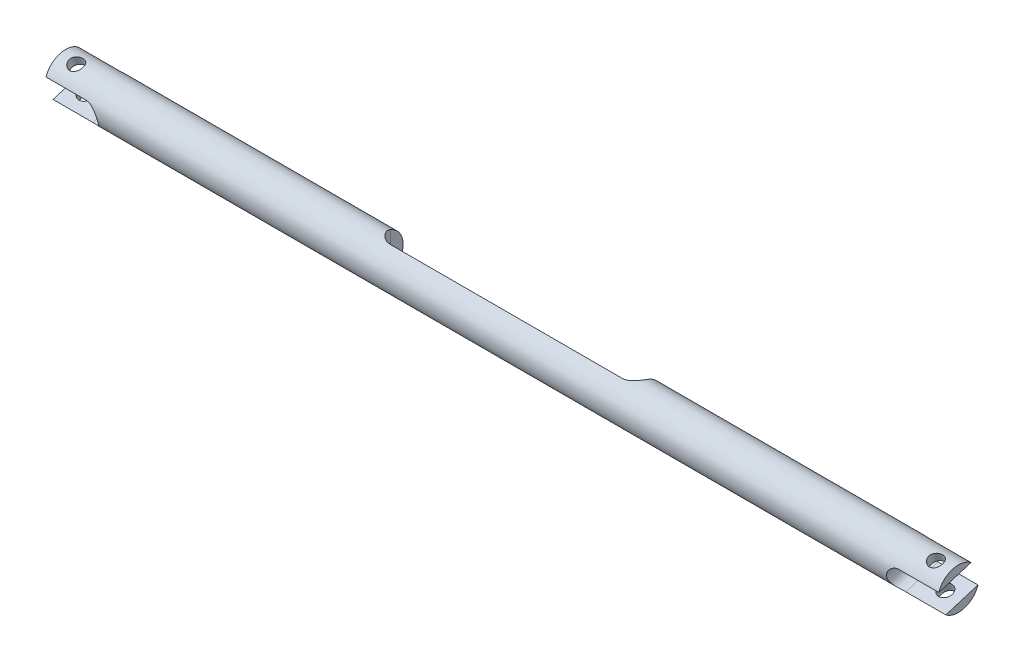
from build123d import *

# Parameters (mm, degrees)
SKETCH1_R                = 9.525
EXTRUDE1_DEPTH           = 205.74
RACK_GEAR_CUT_DEPTH      = 207.180500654
RACK_GEAR_CUT_DEPTH_BACK = 207.180500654
CUT_EXTRUDE3_DEPTH       = 207.180500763
CUT_EXTRUDE3_DEPTH_BACK  = 207.180500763
SKETCH5_R                = 3.175
CUT_EXTRUDE2_DEPTH       = 207.180500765
CUT_EXTRUDE2_DEPTH_BACK  = 207.180500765


with BuildPart() as part:
    # Sketch1 → Extrude1 (new, symmetric)
    with BuildSketch(Plane(origin=(0, 0, 0), x_dir=(0, 0, -1), z_dir=(1, 0, 0))):
        Circle(SKETCH1_R)
    extrude(amount=EXTRUDE1_DEPTH, both=True)

    # Sketch2 → RACK GEAR CUT (cut, two sides: drawn at the far end of the back side and taken through both)
    with BuildSketch(Plane(origin=(0, 0, 0), x_dir=(1, 0, 0), z_dir=(0, 1, 0)).offset(-RACK_GEAR_CUT_DEPTH_BACK)):
        with BuildLine():
            Line((-59.69, 16.40332), (59.69, 16.40332))
            Line((59.69, 16.40332), (59.69, 3.70332))
            ThreePointArc((59.69, 3.70332), (57.830128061, -0.786808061), (53.34, -2.64668))
            Line((53.34, -2.64668), (-53.34, -2.64668))
            ThreePointArc((-53.34, -2.64668), (-57.830128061, -0.786808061), (-59.69, 3.70332))
            Line((-59.69, 3.70332), (-59.69, 16.40332))
        make_face()
    extrude(amount=RACK_GEAR_CUT_DEPTH + RACK_GEAR_CUT_DEPTH_BACK, mode=Mode.SUBTRACT)

    # Sketch5 → Cut-Extrude3 (cut, two sides: drawn at the far end of the back side and taken through both)
    with BuildSketch(Plane(origin=(0, 0, 0), x_dir=(1, 0, 0), z_dir=(0, -0.9563047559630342, -0.2923717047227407)).offset(-CUT_EXTRUDE3_DEPTH_BACK)):
        with Locations(Location((198.12, 0, 0), (0, 0, 270))):
            Circle(SKETCH5_R)
        with Locations(Location((-198.12, 0, 0), (0, 0, 270))):
            Circle(SKETCH5_R)
    extrude(amount=CUT_EXTRUDE3_DEPTH + CUT_EXTRUDE3_DEPTH_BACK, mode=Mode.SUBTRACT)

    # Sketch4 → Cut-Extrude2 (cut, two sides: drawn at the far end of the back side and taken through both)
    with BuildSketch(Plane(origin=(0, 0, 0), x_dir=(1, 0, 0), z_dir=(0, 0.2923717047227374, -0.9563047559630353)).offset(-CUT_EXTRUDE2_DEPTH_BACK)):
        with BuildLine():
            Line((238.125, 5.5245), (187.325, 5.5245))
            ThreePointArc((187.325, 5.5245), (183.418588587, 3.906411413), (181.8005, 0))
            ThreePointArc((181.8005, 0), (183.418588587, -3.906411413), (187.325, -5.5245))
            Line((187.325, -5.5245), (238.125, -5.5245))
            Line((238.125, -5.5245), (238.125, 5.5245))
        make_face()
        with BuildLine():
            Line((-238.125, -5.5245), (-187.325, -5.5245))
            ThreePointArc((-187.325, -5.5245), (-183.418588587, -3.906411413), (-181.8005, 0))
            ThreePointArc((-181.8005, 0), (-183.418588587, 3.906411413), (-187.325, 5.5245))
            Line((-187.325, 5.5245), (-238.125, 5.5245))
            Line((-238.125, 5.5245), (-238.125, -5.5245))
        make_face()
    extrude(amount=CUT_EXTRUDE2_DEPTH + CUT_EXTRUDE2_DEPTH_BACK, mode=Mode.SUBTRACT)


solid = part.part
